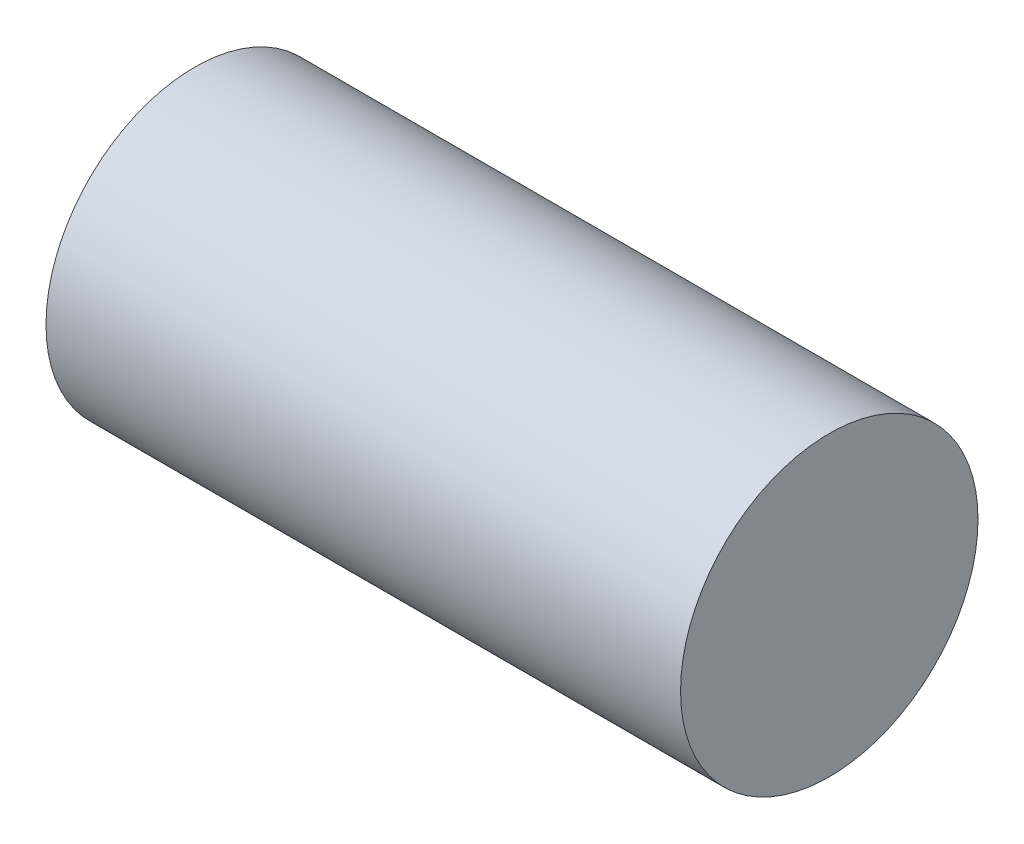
from build123d import *

# Parameters (mm, degrees)
SKETCH1_R           = 4.7625
BOSS_EXTRUDE1_DEPTH = 20.32


with BuildPart() as part:
    # Sketch1 → Boss-Extrude1 (new body)
    with BuildSketch(Plane(origin=(0, 0, 0), x_dir=(0, 0, -1), z_dir=(1, 0, 0))):
        Circle(SKETCH1_R)
    extrude(amount=BOSS_EXTRUDE1_DEPTH)


solid = part.part
